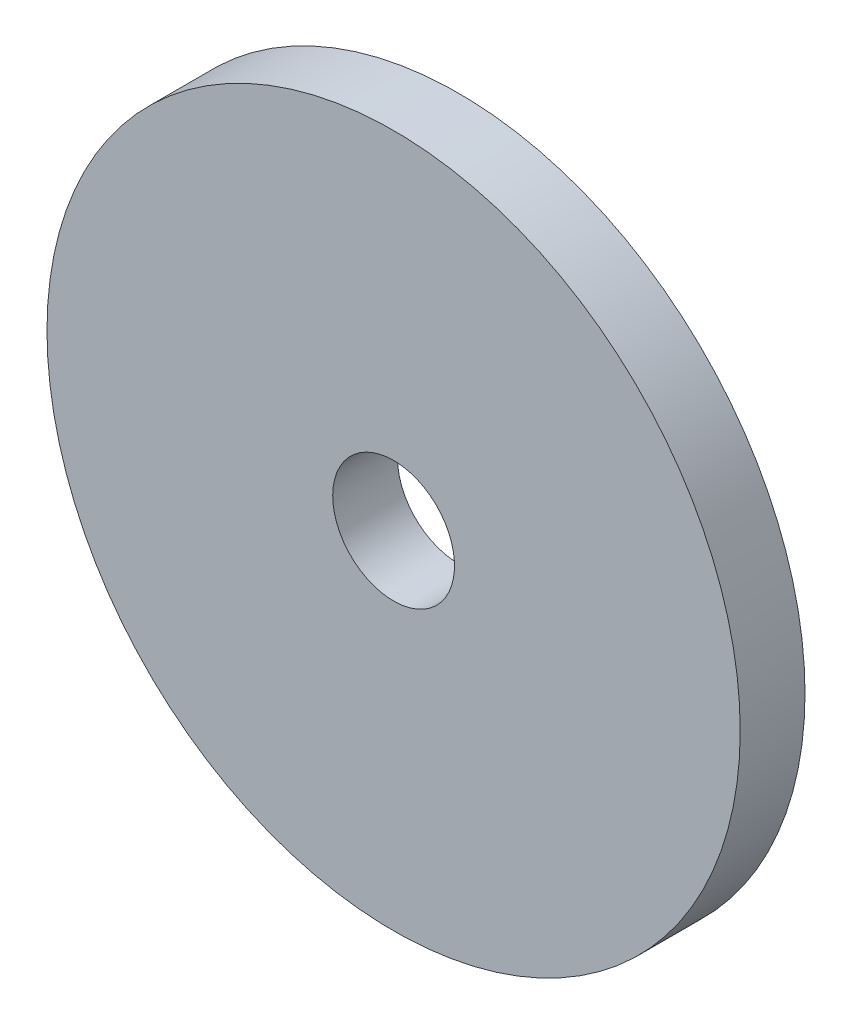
ISO-10303-21;
HEADER;
FILE_DESCRIPTION(('STEP AP214'),'2;1');
FILE_NAME('part.step','',(''),(''),'','','');
FILE_SCHEMA(('AUTOMOTIVE_DESIGN { 1 0 10303 214 1 1 1 1 }'));
ENDSEC;
DATA;
#1=APPLICATION_CONTEXT('core data for automotive mechanical design processes');
#2=APPLICATION_PROTOCOL_DEFINITION('international standard','automotive_design',2000,#1);
#3=PRODUCT_CONTEXT('',#1,'mechanical');
#4=PRODUCT('Part','Part','',(#3));
#5=PRODUCT_RELATED_PRODUCT_CATEGORY('part','',(#4));
#6=PRODUCT_DEFINITION_FORMATION('','',#4);
#7=PRODUCT_DEFINITION_CONTEXT('part definition',#1,'design');
#8=PRODUCT_DEFINITION('design','',#6,#7);
#9=PRODUCT_DEFINITION_SHAPE('','',#8);
#10=(LENGTH_UNIT() NAMED_UNIT(*) SI_UNIT(.MILLI.,.METRE.));
#11=(NAMED_UNIT(*) PLANE_ANGLE_UNIT() SI_UNIT($,.RADIAN.));
#12=(NAMED_UNIT(*) SI_UNIT($,.STERADIAN.) SOLID_ANGLE_UNIT());
#13=UNCERTAINTY_MEASURE_WITH_UNIT(LENGTH_MEASURE(1.E-05),#10,'distance_accuracy_value','');
#14=(GEOMETRIC_REPRESENTATION_CONTEXT(3) GLOBAL_UNCERTAINTY_ASSIGNED_CONTEXT((#13)) GLOBAL_UNIT_ASSIGNED_CONTEXT((#10,
#11,#12)) REPRESENTATION_CONTEXT('',''));
#15=CARTESIAN_POINT('',(0.,0.,0.));
#16=DIRECTION('',(0.,0.,1.));
#17=DIRECTION('',(1.,0.,0.));
#18=AXIS2_PLACEMENT_3D('',#15,#16,#17);
#19=CARTESIAN_POINT('',(0.,0.,2.54));
#20=DIRECTION('',(0.,0.,1.));
#21=DIRECTION('',(1.,0.,0.));
#22=AXIS2_PLACEMENT_3D('',#19,#20,#21);
#23=PLANE('',#22);
#24=CARTESIAN_POINT('',(0.,0.,2.54));
#25=DIRECTION('',(0.,0.,1.));
#26=DIRECTION('',(1.,0.,0.));
#27=AXIS2_PLACEMENT_3D('',#24,#25,#26);
#28=CIRCLE('',#27,13.589);
#29=CARTESIAN_POINT('',(-13.589,0.,2.54));
#30=VERTEX_POINT('',#29);
#31=EDGE_CURVE('E10',#30,#30,#28,.T.);
#32=ORIENTED_EDGE('',*,*,#31,.T.);
#33=EDGE_LOOP('',(#32));
#34=FACE_BOUND('',#33,.T.);
#35=CARTESIAN_POINT('',(0.,0.,2.54));
#36=DIRECTION('',(0.,0.,1.));
#37=DIRECTION('',(1.,0.,0.));
#38=AXIS2_PLACEMENT_3D('',#35,#36,#37);
#39=CIRCLE('',#38,2.3876);
#40=CARTESIAN_POINT('',(-2.3876,0.,2.54));
#41=VERTEX_POINT('',#40);
#42=EDGE_CURVE('E39',#41,#41,#39,.T.);
#43=ORIENTED_EDGE('',*,*,#42,.F.);
#44=EDGE_LOOP('',(#43));
#45=FACE_BOUND('',#44,.T.);
#46=ADVANCED_FACE('F28',(#34,#45),#23,.T.);
#47=CARTESIAN_POINT('',(0.,0.,0.));
#48=DIRECTION('',(0.,0.,1.));
#49=DIRECTION('',(1.,0.,0.));
#50=AXIS2_PLACEMENT_3D('',#47,#48,#49);
#51=PLANE('',#50);
#52=CARTESIAN_POINT('',(0.,0.,0.));
#53=DIRECTION('',(0.,0.,1.));
#54=DIRECTION('',(1.,0.,0.));
#55=AXIS2_PLACEMENT_3D('',#52,#53,#54);
#56=CIRCLE('',#55,13.589);
#57=CARTESIAN_POINT('',(-13.589,0.,0.));
#58=VERTEX_POINT('',#57);
#59=EDGE_CURVE('E35',#58,#58,#56,.T.);
#60=ORIENTED_EDGE('',*,*,#59,.F.);
#61=EDGE_LOOP('',(#60));
#62=FACE_BOUND('',#61,.T.);
#63=CARTESIAN_POINT('',(0.,0.,0.));
#64=DIRECTION('',(0.,0.,1.));
#65=DIRECTION('',(1.,0.,0.));
#66=AXIS2_PLACEMENT_3D('',#63,#64,#65);
#67=CIRCLE('',#66,2.3876);
#68=CARTESIAN_POINT('',(-2.3876,0.,0.));
#69=VERTEX_POINT('',#68);
#70=EDGE_CURVE('E43',#69,#69,#67,.T.);
#71=ORIENTED_EDGE('',*,*,#70,.T.);
#72=EDGE_LOOP('',(#71));
#73=FACE_BOUND('',#72,.T.);
#74=ADVANCED_FACE('F49',(#62,#73),#51,.F.);
#75=CARTESIAN_POINT('',(0.,0.,2.54));
#76=DIRECTION('',(0.,0.,-1.));
#77=DIRECTION('',(-1.,0.,0.));
#78=AXIS2_PLACEMENT_3D('',#75,#76,#77);
#79=CYLINDRICAL_SURFACE('',#78,13.589);
#80=CARTESIAN_POINT('',(-13.589,0.,2.54));
#81=CARTESIAN_POINT('',(-13.589,0.,2.51354166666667));
#82=CARTESIAN_POINT('',(-13.589,0.,2.48708333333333));
#83=CARTESIAN_POINT('',(-13.589,0.,2.43416666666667));
#84=CARTESIAN_POINT('',(-13.589,0.,2.40770833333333));
#85=CARTESIAN_POINT('',(-13.589,0.,2.35479166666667));
#86=CARTESIAN_POINT('',(-13.589,0.,2.32833333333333));
#87=CARTESIAN_POINT('',(-13.589,0.,2.27541666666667));
#88=CARTESIAN_POINT('',(-13.589,0.,2.24895833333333));
#89=CARTESIAN_POINT('',(-13.589,0.,2.19604166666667));
#90=CARTESIAN_POINT('',(-13.589,0.,2.16958333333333));
#91=CARTESIAN_POINT('',(-13.589,0.,2.11666666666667));
#92=CARTESIAN_POINT('',(-13.589,0.,2.09020833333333));
#93=CARTESIAN_POINT('',(-13.589,0.,2.03729166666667));
#94=CARTESIAN_POINT('',(-13.589,0.,2.01083333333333));
#95=CARTESIAN_POINT('',(-13.589,0.,1.95791666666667));
#96=CARTESIAN_POINT('',(-13.589,0.,1.93145833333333));
#97=CARTESIAN_POINT('',(-13.589,0.,1.87854166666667));
#98=CARTESIAN_POINT('',(-13.589,0.,1.85208333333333));
#99=CARTESIAN_POINT('',(-13.589,0.,1.79916666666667));
#100=CARTESIAN_POINT('',(-13.589,0.,1.77270833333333));
#101=CARTESIAN_POINT('',(-13.589,0.,1.71979166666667));
#102=CARTESIAN_POINT('',(-13.589,0.,1.69333333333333));
#103=CARTESIAN_POINT('',(-13.589,0.,1.64041666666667));
#104=CARTESIAN_POINT('',(-13.589,0.,1.61395833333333));
#105=CARTESIAN_POINT('',(-13.589,0.,1.56104166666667));
#106=CARTESIAN_POINT('',(-13.589,0.,1.53458333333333));
#107=CARTESIAN_POINT('',(-13.589,0.,1.48166666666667));
#108=CARTESIAN_POINT('',(-13.589,0.,1.45520833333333));
#109=CARTESIAN_POINT('',(-13.589,0.,1.40229166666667));
#110=CARTESIAN_POINT('',(-13.589,0.,1.37583333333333));
#111=CARTESIAN_POINT('',(-13.589,0.,1.32291666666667));
#112=CARTESIAN_POINT('',(-13.589,0.,1.29645833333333));
#113=CARTESIAN_POINT('',(-13.589,0.,1.24354166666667));
#114=CARTESIAN_POINT('',(-13.589,0.,1.21708333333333));
#115=CARTESIAN_POINT('',(-13.589,0.,1.16416666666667));
#116=CARTESIAN_POINT('',(-13.589,0.,1.13770833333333));
#117=CARTESIAN_POINT('',(-13.589,0.,1.08479166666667));
#118=CARTESIAN_POINT('',(-13.589,0.,1.05833333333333));
#119=CARTESIAN_POINT('',(-13.589,0.,1.00541666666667));
#120=CARTESIAN_POINT('',(-13.589,0.,0.978958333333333));
#121=CARTESIAN_POINT('',(-13.589,0.,0.926041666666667));
#122=CARTESIAN_POINT('',(-13.589,0.,0.899583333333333));
#123=CARTESIAN_POINT('',(-13.589,0.,0.846666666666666));
#124=CARTESIAN_POINT('',(-13.589,0.,0.820208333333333));
#125=CARTESIAN_POINT('',(-13.589,0.,0.767291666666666));
#126=CARTESIAN_POINT('',(-13.589,0.,0.740833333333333));
#127=CARTESIAN_POINT('',(-13.589,0.,0.687916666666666));
#128=CARTESIAN_POINT('',(-13.589,0.,0.661458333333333));
#129=CARTESIAN_POINT('',(-13.589,0.,0.608541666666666));
#130=CARTESIAN_POINT('',(-13.589,0.,0.582083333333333));
#131=CARTESIAN_POINT('',(-13.589,0.,0.529166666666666));
#132=CARTESIAN_POINT('',(-13.589,0.,0.502708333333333));
#133=CARTESIAN_POINT('',(-13.589,0.,0.449791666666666));
#134=CARTESIAN_POINT('',(-13.589,0.,0.423333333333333));
#135=CARTESIAN_POINT('',(-13.589,0.,0.370416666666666));
#136=CARTESIAN_POINT('',(-13.589,0.,0.343958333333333));
#137=CARTESIAN_POINT('',(-13.589,0.,0.291041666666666));
#138=CARTESIAN_POINT('',(-13.589,0.,0.264583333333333));
#139=CARTESIAN_POINT('',(-13.589,0.,0.211666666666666));
#140=CARTESIAN_POINT('',(-13.589,0.,0.185208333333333));
#141=CARTESIAN_POINT('',(-13.589,0.,0.132291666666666));
#142=CARTESIAN_POINT('',(-13.589,0.,0.105833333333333));
#143=CARTESIAN_POINT('',(-13.589,0.,0.0529166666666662));
#144=CARTESIAN_POINT('',(-13.589,0.,0.0264583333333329));
#145=CARTESIAN_POINT('',(-13.589,0.,0.));
#146=B_SPLINE_CURVE_WITH_KNOTS('',3,(#80,#81,#82,#83,#84,#85,#86,#87,#88,#89,#90,#91,#92,#93,
#94,#95,#96,#97,#98,#99,#100,#101,#102,#103,#104,#105,#106,#107,#108,#109,#110,#111,#112,#113,
#114,#115,#116,#117,#118,#119,#120,#121,#122,#123,#124,#125,#126,#127,#128,#129,#130,#131,#132,
#133,#134,#135,#136,#137,#138,#139,#140,#141,#142,#143,#144,#145),.UNSPECIFIED.,.F.,.F.,(4,2,2,
2,2,2,2,2,2,2,2,2,2,2,2,2,2,2,2,2,2,2,2,2,2,2,2,2,2,2,2,2,4),(0.,0.0793750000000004,0.15875,
0.238125,0.317500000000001,0.396875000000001,0.476250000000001,0.555625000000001,
0.635000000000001,0.714375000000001,0.79375,0.873125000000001,0.952500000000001,1.031875,
1.11125,1.190625,1.27,1.349375,1.42875,1.508125,1.5875,1.666875,1.74625,1.825625,1.905,1.984375,
2.06375,2.143125,2.2225,2.301875,2.38125,2.460625,2.54),.UNSPECIFIED.);
#147=EDGE_CURVE('BSEAM30',#30,#58,#146,.T.);
#148=ORIENTED_EDGE('',*,*,#31,.F.);
#149=ORIENTED_EDGE('',*,*,#59,.T.);
#150=ORIENTED_EDGE('',*,*,#147,.T.);
#151=ORIENTED_EDGE('',*,*,#147,.F.);
#152=EDGE_LOOP('',(#148,#150,#149,#151));
#153=FACE_BOUND('',#152,.T.);
#154=ADVANCED_FACE('F30',(#153),#79,.T.);
#155=CARTESIAN_POINT('',(0.,0.,2.54));
#156=DIRECTION('',(0.,0.,-1.));
#157=DIRECTION('',(-1.,0.,0.));
#158=AXIS2_PLACEMENT_3D('',#155,#156,#157);
#159=CYLINDRICAL_SURFACE('',#158,2.3876);
#160=CARTESIAN_POINT('',(-2.3876,0.,2.54));
#161=CARTESIAN_POINT('',(-2.3876,0.,2.51354166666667));
#162=CARTESIAN_POINT('',(-2.3876,0.,2.48708333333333));
#163=CARTESIAN_POINT('',(-2.3876,0.,2.43416666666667));
#164=CARTESIAN_POINT('',(-2.3876,0.,2.40770833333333));
#165=CARTESIAN_POINT('',(-2.3876,0.,2.35479166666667));
#166=CARTESIAN_POINT('',(-2.3876,0.,2.32833333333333));
#167=CARTESIAN_POINT('',(-2.3876,0.,2.27541666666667));
#168=CARTESIAN_POINT('',(-2.3876,0.,2.24895833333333));
#169=CARTESIAN_POINT('',(-2.3876,0.,2.19604166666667));
#170=CARTESIAN_POINT('',(-2.3876,0.,2.16958333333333));
#171=CARTESIAN_POINT('',(-2.3876,0.,2.11666666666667));
#172=CARTESIAN_POINT('',(-2.3876,0.,2.09020833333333));
#173=CARTESIAN_POINT('',(-2.3876,0.,2.03729166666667));
#174=CARTESIAN_POINT('',(-2.3876,0.,2.01083333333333));
#175=CARTESIAN_POINT('',(-2.3876,0.,1.95791666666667));
#176=CARTESIAN_POINT('',(-2.3876,0.,1.93145833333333));
#177=CARTESIAN_POINT('',(-2.3876,0.,1.87854166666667));
#178=CARTESIAN_POINT('',(-2.3876,0.,1.85208333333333));
#179=CARTESIAN_POINT('',(-2.3876,0.,1.79916666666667));
#180=CARTESIAN_POINT('',(-2.3876,0.,1.77270833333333));
#181=CARTESIAN_POINT('',(-2.3876,0.,1.71979166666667));
#182=CARTESIAN_POINT('',(-2.3876,0.,1.69333333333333));
#183=CARTESIAN_POINT('',(-2.3876,0.,1.64041666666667));
#184=CARTESIAN_POINT('',(-2.3876,0.,1.61395833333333));
#185=CARTESIAN_POINT('',(-2.3876,0.,1.56104166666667));
#186=CARTESIAN_POINT('',(-2.3876,0.,1.53458333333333));
#187=CARTESIAN_POINT('',(-2.3876,0.,1.48166666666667));
#188=CARTESIAN_POINT('',(-2.3876,0.,1.45520833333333));
#189=CARTESIAN_POINT('',(-2.3876,0.,1.40229166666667));
#190=CARTESIAN_POINT('',(-2.3876,0.,1.37583333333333));
#191=CARTESIAN_POINT('',(-2.3876,0.,1.32291666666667));
#192=CARTESIAN_POINT('',(-2.3876,0.,1.29645833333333));
#193=CARTESIAN_POINT('',(-2.3876,0.,1.24354166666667));
#194=CARTESIAN_POINT('',(-2.3876,0.,1.21708333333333));
#195=CARTESIAN_POINT('',(-2.3876,0.,1.16416666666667));
#196=CARTESIAN_POINT('',(-2.3876,0.,1.13770833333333));
#197=CARTESIAN_POINT('',(-2.3876,0.,1.08479166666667));
#198=CARTESIAN_POINT('',(-2.3876,0.,1.05833333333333));
#199=CARTESIAN_POINT('',(-2.3876,0.,1.00541666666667));
#200=CARTESIAN_POINT('',(-2.3876,0.,0.978958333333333));
#201=CARTESIAN_POINT('',(-2.3876,0.,0.926041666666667));
#202=CARTESIAN_POINT('',(-2.3876,0.,0.899583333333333));
#203=CARTESIAN_POINT('',(-2.3876,0.,0.846666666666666));
#204=CARTESIAN_POINT('',(-2.3876,0.,0.820208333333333));
#205=CARTESIAN_POINT('',(-2.3876,0.,0.767291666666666));
#206=CARTESIAN_POINT('',(-2.3876,0.,0.740833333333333));
#207=CARTESIAN_POINT('',(-2.3876,0.,0.687916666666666));
#208=CARTESIAN_POINT('',(-2.3876,0.,0.661458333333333));
#209=CARTESIAN_POINT('',(-2.3876,0.,0.608541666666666));
#210=CARTESIAN_POINT('',(-2.3876,0.,0.582083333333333));
#211=CARTESIAN_POINT('',(-2.3876,0.,0.529166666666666));
#212=CARTESIAN_POINT('',(-2.3876,0.,0.502708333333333));
#213=CARTESIAN_POINT('',(-2.3876,0.,0.449791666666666));
#214=CARTESIAN_POINT('',(-2.3876,0.,0.423333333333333));
#215=CARTESIAN_POINT('',(-2.3876,0.,0.370416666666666));
#216=CARTESIAN_POINT('',(-2.3876,0.,0.343958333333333));
#217=CARTESIAN_POINT('',(-2.3876,0.,0.291041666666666));
#218=CARTESIAN_POINT('',(-2.3876,0.,0.264583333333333));
#219=CARTESIAN_POINT('',(-2.3876,0.,0.211666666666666));
#220=CARTESIAN_POINT('',(-2.3876,0.,0.185208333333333));
#221=CARTESIAN_POINT('',(-2.3876,0.,0.132291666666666));
#222=CARTESIAN_POINT('',(-2.3876,0.,0.105833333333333));
#223=CARTESIAN_POINT('',(-2.3876,0.,0.0529166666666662));
#224=CARTESIAN_POINT('',(-2.3876,0.,0.0264583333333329));
#225=CARTESIAN_POINT('',(-2.3876,0.,0.));
#226=B_SPLINE_CURVE_WITH_KNOTS('',3,(#160,#161,#162,#163,#164,#165,#166,#167,#168,#169,#170,
#171,#172,#173,#174,#175,#176,#177,#178,#179,#180,#181,#182,#183,#184,#185,#186,#187,#188,#189,
#190,#191,#192,#193,#194,#195,#196,#197,#198,#199,#200,#201,#202,#203,#204,#205,#206,#207,#208,
#209,#210,#211,#212,#213,#214,#215,#216,#217,#218,#219,#220,#221,#222,#223,#224,#225),
.UNSPECIFIED.,.F.,.F.,(4,2,2,2,2,2,2,2,2,2,2,2,2,2,2,2,2,2,2,2,2,2,2,2,2,2,2,2,2,2,2,2,4),(0.,
0.0793750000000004,0.15875,0.238125,0.317500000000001,0.396875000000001,0.476250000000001,
0.555625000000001,0.635000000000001,0.714375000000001,0.79375,0.873125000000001,
0.952500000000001,1.031875,1.11125,1.190625,1.27,1.349375,1.42875,1.508125,1.5875,1.666875,
1.74625,1.825625,1.905,1.984375,2.06375,2.143125,2.2225,2.301875,2.38125,2.460625,2.54),.UNSPECIFIED.);
#227=EDGE_CURVE('BSEAM51',#41,#69,#226,.T.);
#228=ORIENTED_EDGE('',*,*,#42,.T.);
#229=ORIENTED_EDGE('',*,*,#70,.F.);
#230=ORIENTED_EDGE('',*,*,#227,.T.);
#231=ORIENTED_EDGE('',*,*,#227,.F.);
#232=EDGE_LOOP('',(#228,#230,#229,#231));
#233=FACE_BOUND('',#232,.T.);
#234=ADVANCED_FACE('F51',(#233),#159,.F.);
#235=CLOSED_SHELL('',(#46,#74,#154,#234));
#236=MANIFOLD_SOLID_BREP('B2',#235);
#237=ADVANCED_BREP_SHAPE_REPRESENTATION('',(#18,#236),#14);
#238=SHAPE_DEFINITION_REPRESENTATION(#9,#237);
ENDSEC;
END-ISO-10303-21;
